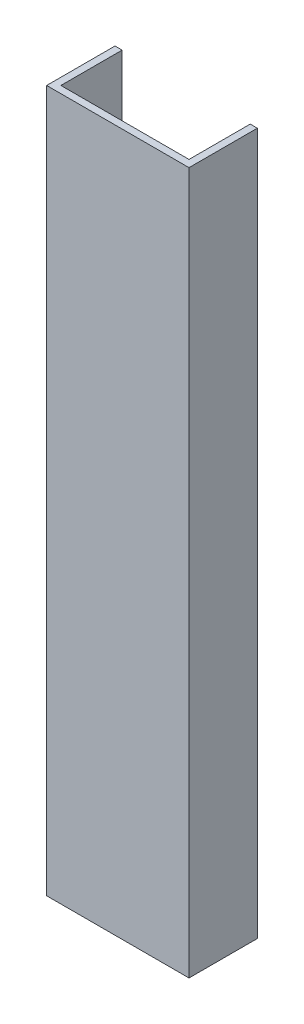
ISO-10303-21;
HEADER;
FILE_DESCRIPTION(('STEP AP214'),'2;1');
FILE_NAME('part.step','',(''),(''),'','','');
FILE_SCHEMA(('AUTOMOTIVE_DESIGN { 1 0 10303 214 1 1 1 1 }'));
ENDSEC;
DATA;
#1=APPLICATION_CONTEXT('core data for automotive mechanical design processes');
#2=APPLICATION_PROTOCOL_DEFINITION('international standard','automotive_design',2000,#1);
#3=PRODUCT_CONTEXT('',#1,'mechanical');
#4=PRODUCT('Part','Part','',(#3));
#5=PRODUCT_RELATED_PRODUCT_CATEGORY('part','',(#4));
#6=PRODUCT_DEFINITION_FORMATION('','',#4);
#7=PRODUCT_DEFINITION_CONTEXT('part definition',#1,'design');
#8=PRODUCT_DEFINITION('design','',#6,#7);
#9=PRODUCT_DEFINITION_SHAPE('','',#8);
#10=(LENGTH_UNIT() NAMED_UNIT(*) SI_UNIT(.MILLI.,.METRE.));
#11=(NAMED_UNIT(*) PLANE_ANGLE_UNIT() SI_UNIT($,.RADIAN.));
#12=(NAMED_UNIT(*) SI_UNIT($,.STERADIAN.) SOLID_ANGLE_UNIT());
#13=UNCERTAINTY_MEASURE_WITH_UNIT(LENGTH_MEASURE(1.E-05),#10,'distance_accuracy_value','');
#14=(GEOMETRIC_REPRESENTATION_CONTEXT(3) GLOBAL_UNCERTAINTY_ASSIGNED_CONTEXT((#13)) GLOBAL_UNIT_ASSIGNED_CONTEXT((#10,
#11,#12)) REPRESENTATION_CONTEXT('',''));
#15=CARTESIAN_POINT('',(0.,0.,0.));
#16=DIRECTION('',(0.,0.,1.));
#17=DIRECTION('',(1.,0.,0.));
#18=AXIS2_PLACEMENT_3D('',#15,#16,#17);
#19=CARTESIAN_POINT('',(45.,493.,-48.));
#20=DIRECTION('',(0.,0.,1.));
#21=DIRECTION('',(1.,0.,0.));
#22=AXIS2_PLACEMENT_3D('',#19,#20,#21);
#23=PLANE('',#22);
#24=DIRECTION('',(-1.,0.,0.));
#25=VECTOR('',#24,1.);
#26=CARTESIAN_POINT('',(45.,0.,-48.));
#27=LINE('',#26,#25);
#28=CARTESIAN_POINT('',(50.,0.,-48.));
#29=VERTEX_POINT('',#28);
#30=CARTESIAN_POINT('',(45.,0.,-48.));
#31=VERTEX_POINT('',#30);
#32=EDGE_CURVE('E128',#29,#31,#27,.T.);
#33=ORIENTED_EDGE('',*,*,#32,.T.);
#34=DIRECTION('',(0.,-1.,0.));
#35=VECTOR('',#34,1.);
#36=CARTESIAN_POINT('',(45.,493.,-48.));
#37=LINE('',#36,#35);
#38=CARTESIAN_POINT('',(45.,493.,-48.));
#39=VERTEX_POINT('',#38);
#40=EDGE_CURVE('E11',#39,#31,#37,.T.);
#41=ORIENTED_EDGE('',*,*,#40,.F.);
#42=DIRECTION('',(-1.,0.,0.));
#43=VECTOR('',#42,1.);
#44=CARTESIAN_POINT('',(45.,493.,-48.));
#45=LINE('',#44,#43);
#46=CARTESIAN_POINT('',(50.,493.,-48.));
#47=VERTEX_POINT('',#46);
#48=EDGE_CURVE('E142',#47,#39,#45,.T.);
#49=ORIENTED_EDGE('',*,*,#48,.F.);
#50=DIRECTION('',(0.,-1.,0.));
#51=VECTOR('',#50,1.);
#52=CARTESIAN_POINT('',(50.,493.,-48.));
#53=LINE('',#52,#51);
#54=EDGE_CURVE('E124',#47,#29,#53,.T.);
#55=ORIENTED_EDGE('',*,*,#54,.T.);
#56=EDGE_LOOP('',(#33,#41,#49,#55));
#57=FACE_BOUND('',#56,.T.);
#58=ADVANCED_FACE('F32',(#57),#23,.F.);
#59=CARTESIAN_POINT('',(45.,493.,-48.));
#60=DIRECTION('',(1.,0.,0.));
#61=DIRECTION('',(0.,0.,-1.));
#62=AXIS2_PLACEMENT_3D('',#59,#60,#61);
#63=PLANE('',#62);
#64=DIRECTION('',(0.,0.,1.));
#65=VECTOR('',#64,1.);
#66=CARTESIAN_POINT('',(45.,0.,-48.));
#67=LINE('',#66,#65);
#68=CARTESIAN_POINT('',(45.,0.,-4.99999999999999));
#69=VERTEX_POINT('',#68);
#70=EDGE_CURVE('E131',#31,#69,#67,.T.);
#71=ORIENTED_EDGE('',*,*,#70,.T.);
#72=DIRECTION('',(0.,-1.,0.));
#73=VECTOR('',#72,1.);
#74=CARTESIAN_POINT('',(45.,493.,-4.99999999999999));
#75=LINE('',#74,#73);
#76=CARTESIAN_POINT('',(45.,493.,-4.99999999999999));
#77=VERTEX_POINT('',#76);
#78=EDGE_CURVE('E40',#77,#69,#75,.T.);
#79=ORIENTED_EDGE('',*,*,#78,.F.);
#80=DIRECTION('',(0.,0.,1.));
#81=VECTOR('',#80,1.);
#82=CARTESIAN_POINT('',(45.,493.,-48.));
#83=LINE('',#82,#81);
#84=EDGE_CURVE('E91',#39,#77,#83,.T.);
#85=ORIENTED_EDGE('',*,*,#84,.F.);
#86=ORIENTED_EDGE('',*,*,#40,.T.);
#87=EDGE_LOOP('',(#71,#79,#85,#86));
#88=FACE_BOUND('',#87,.T.);
#89=ADVANCED_FACE('F177',(#88),#63,.F.);
#90=CARTESIAN_POINT('',(45.,493.,-4.99999999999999));
#91=DIRECTION('',(0.,0.,1.));
#92=DIRECTION('',(1.,0.,0.));
#93=AXIS2_PLACEMENT_3D('',#90,#91,#92);
#94=PLANE('',#93);
#95=DIRECTION('',(-1.,0.,0.));
#96=VECTOR('',#95,1.);
#97=CARTESIAN_POINT('',(45.,0.,-4.99999999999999));
#98=LINE('',#97,#96);
#99=CARTESIAN_POINT('',(-45.,0.,-4.99999999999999));
#100=VERTEX_POINT('',#99);
#101=EDGE_CURVE('E133',#69,#100,#98,.T.);
#102=ORIENTED_EDGE('',*,*,#101,.T.);
#103=DIRECTION('',(0.,-1.,0.));
#104=VECTOR('',#103,1.);
#105=CARTESIAN_POINT('',(-45.,493.,-4.99999999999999));
#106=LINE('',#105,#104);
#107=CARTESIAN_POINT('',(-45.,493.,-4.99999999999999));
#108=VERTEX_POINT('',#107);
#109=EDGE_CURVE('E149',#108,#100,#106,.T.);
#110=ORIENTED_EDGE('',*,*,#109,.F.);
#111=DIRECTION('',(-1.,0.,0.));
#112=VECTOR('',#111,1.);
#113=CARTESIAN_POINT('',(45.,493.,-4.99999999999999));
#114=LINE('',#113,#112);
#115=EDGE_CURVE('E157',#77,#108,#114,.T.);
#116=ORIENTED_EDGE('',*,*,#115,.F.);
#117=ORIENTED_EDGE('',*,*,#78,.T.);
#118=EDGE_LOOP('',(#102,#110,#116,#117));
#119=FACE_BOUND('',#118,.T.);
#120=ADVANCED_FACE('F155',(#119),#94,.F.);
#121=CARTESIAN_POINT('',(-45.,493.,-4.99999999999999));
#122=DIRECTION('',(-1.,0.,0.));
#123=DIRECTION('',(0.,0.,1.));
#124=AXIS2_PLACEMENT_3D('',#121,#122,#123);
#125=PLANE('',#124);
#126=DIRECTION('',(0.,0.,-1.));
#127=VECTOR('',#126,1.);
#128=CARTESIAN_POINT('',(-45.,0.,-4.99999999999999));
#129=LINE('',#128,#127);
#130=CARTESIAN_POINT('',(-45.,0.,-48.));
#131=VERTEX_POINT('',#130);
#132=EDGE_CURVE('E135',#100,#131,#129,.T.);
#133=ORIENTED_EDGE('',*,*,#132,.T.);
#134=DIRECTION('',(0.,-1.,0.));
#135=VECTOR('',#134,1.);
#136=CARTESIAN_POINT('',(-45.,493.,-48.));
#137=LINE('',#136,#135);
#138=CARTESIAN_POINT('',(-45.,493.,-48.));
#139=VERTEX_POINT('',#138);
#140=EDGE_CURVE('E146',#139,#131,#137,.T.);
#141=ORIENTED_EDGE('',*,*,#140,.F.);
#142=DIRECTION('',(0.,0.,-1.));
#143=VECTOR('',#142,1.);
#144=CARTESIAN_POINT('',(-45.,493.,-4.99999999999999));
#145=LINE('',#144,#143);
#146=EDGE_CURVE('E169',#108,#139,#145,.T.);
#147=ORIENTED_EDGE('',*,*,#146,.F.);
#148=ORIENTED_EDGE('',*,*,#109,.T.);
#149=EDGE_LOOP('',(#133,#141,#147,#148));
#150=FACE_BOUND('',#149,.T.);
#151=ADVANCED_FACE('F165',(#150),#125,.F.);
#152=CARTESIAN_POINT('',(-50.,493.,-48.));
#153=DIRECTION('',(0.,0.,1.));
#154=DIRECTION('',(1.,0.,0.));
#155=AXIS2_PLACEMENT_3D('',#152,#153,#154);
#156=PLANE('',#155);
#157=DIRECTION('',(-1.,0.,0.));
#158=VECTOR('',#157,1.);
#159=CARTESIAN_POINT('',(-50.,0.,-48.));
#160=LINE('',#159,#158);
#161=CARTESIAN_POINT('',(-50.,0.,-48.));
#162=VERTEX_POINT('',#161);
#163=EDGE_CURVE('E137',#131,#162,#160,.T.);
#164=ORIENTED_EDGE('',*,*,#163,.T.);
#165=DIRECTION('',(0.,-1.,0.));
#166=VECTOR('',#165,1.);
#167=CARTESIAN_POINT('',(-50.,493.,-48.));
#168=LINE('',#167,#166);
#169=CARTESIAN_POINT('',(-50.,493.,-48.));
#170=VERTEX_POINT('',#169);
#171=EDGE_CURVE('E119',#170,#162,#168,.T.);
#172=ORIENTED_EDGE('',*,*,#171,.F.);
#173=DIRECTION('',(-1.,0.,0.));
#174=VECTOR('',#173,1.);
#175=CARTESIAN_POINT('',(-50.,493.,-48.));
#176=LINE('',#175,#174);
#177=EDGE_CURVE('E110',#139,#170,#176,.T.);
#178=ORIENTED_EDGE('',*,*,#177,.F.);
#179=ORIENTED_EDGE('',*,*,#140,.T.);
#180=EDGE_LOOP('',(#164,#172,#178,#179));
#181=FACE_BOUND('',#180,.T.);
#182=ADVANCED_FACE('F168',(#181),#156,.F.);
#183=CARTESIAN_POINT('',(-50.,493.,0.));
#184=DIRECTION('',(1.,0.,0.));
#185=DIRECTION('',(0.,0.,-1.));
#186=AXIS2_PLACEMENT_3D('',#183,#184,#185);
#187=PLANE('',#186);
#188=DIRECTION('',(0.,0.,1.));
#189=VECTOR('',#188,1.);
#190=CARTESIAN_POINT('',(-50.,0.,0.));
#191=LINE('',#190,#189);
#192=CARTESIAN_POINT('',(-50.,0.,0.));
#193=VERTEX_POINT('',#192);
#194=EDGE_CURVE('E118',#162,#193,#191,.T.);
#195=ORIENTED_EDGE('',*,*,#194,.T.);
#196=DIRECTION('',(0.,-1.,0.));
#197=VECTOR('',#196,1.);
#198=CARTESIAN_POINT('',(-50.,493.,0.));
#199=LINE('',#198,#197);
#200=CARTESIAN_POINT('',(-50.,493.,0.));
#201=VERTEX_POINT('',#200);
#202=EDGE_CURVE('E115',#201,#193,#199,.T.);
#203=ORIENTED_EDGE('',*,*,#202,.F.);
#204=DIRECTION('',(0.,0.,1.));
#205=VECTOR('',#204,1.);
#206=CARTESIAN_POINT('',(-50.,493.,0.));
#207=LINE('',#206,#205);
#208=EDGE_CURVE('E104',#170,#201,#207,.T.);
#209=ORIENTED_EDGE('',*,*,#208,.F.);
#210=ORIENTED_EDGE('',*,*,#171,.T.);
#211=EDGE_LOOP('',(#195,#203,#209,#210));
#212=FACE_BOUND('',#211,.T.);
#213=ADVANCED_FACE('F116',(#212),#187,.F.);
#214=CARTESIAN_POINT('',(-50.,493.,0.));
#215=DIRECTION('',(0.,0.,-1.));
#216=DIRECTION('',(-1.,0.,0.));
#217=AXIS2_PLACEMENT_3D('',#214,#215,#216);
#218=PLANE('',#217);
#219=DIRECTION('',(1.,0.,0.));
#220=VECTOR('',#219,1.);
#221=CARTESIAN_POINT('',(-50.,0.,0.));
#222=LINE('',#221,#220);
#223=CARTESIAN_POINT('',(50.,0.,0.));
#224=VERTEX_POINT('',#223);
#225=EDGE_CURVE('E77',#193,#224,#222,.T.);
#226=ORIENTED_EDGE('',*,*,#225,.T.);
#227=DIRECTION('',(0.,-1.,0.));
#228=VECTOR('',#227,1.);
#229=CARTESIAN_POINT('',(50.,493.,0.));
#230=LINE('',#229,#228);
#231=CARTESIAN_POINT('',(50.,493.,0.));
#232=VERTEX_POINT('',#231);
#233=EDGE_CURVE('E120',#232,#224,#230,.T.);
#234=ORIENTED_EDGE('',*,*,#233,.F.);
#235=DIRECTION('',(1.,0.,0.));
#236=VECTOR('',#235,1.);
#237=CARTESIAN_POINT('',(-50.,493.,0.));
#238=LINE('',#237,#236);
#239=EDGE_CURVE('E108',#201,#232,#238,.T.);
#240=ORIENTED_EDGE('',*,*,#239,.F.);
#241=ORIENTED_EDGE('',*,*,#202,.T.);
#242=EDGE_LOOP('',(#226,#234,#240,#241));
#243=FACE_BOUND('',#242,.T.);
#244=ADVANCED_FACE('F122',(#243),#218,.F.);
#245=CARTESIAN_POINT('',(50.,493.,0.));
#246=DIRECTION('',(-1.,0.,0.));
#247=DIRECTION('',(0.,0.,1.));
#248=AXIS2_PLACEMENT_3D('',#245,#246,#247);
#249=PLANE('',#248);
#250=DIRECTION('',(0.,0.,-1.));
#251=VECTOR('',#250,1.);
#252=CARTESIAN_POINT('',(50.,0.,0.));
#253=LINE('',#252,#251);
#254=EDGE_CURVE('E83',#224,#29,#253,.T.);
#255=ORIENTED_EDGE('',*,*,#254,.T.);
#256=ORIENTED_EDGE('',*,*,#54,.F.);
#257=DIRECTION('',(0.,0.,-1.));
#258=VECTOR('',#257,1.);
#259=CARTESIAN_POINT('',(50.,493.,0.));
#260=LINE('',#259,#258);
#261=EDGE_CURVE('E48',#232,#47,#260,.T.);
#262=ORIENTED_EDGE('',*,*,#261,.F.);
#263=ORIENTED_EDGE('',*,*,#233,.T.);
#264=EDGE_LOOP('',(#255,#256,#262,#263));
#265=FACE_BOUND('',#264,.T.);
#266=ADVANCED_FACE('F193',(#265),#249,.F.);
#267=CARTESIAN_POINT('',(0.,493.,0.));
#268=DIRECTION('',(0.,1.,0.));
#269=DIRECTION('',(0.,0.,1.));
#270=AXIS2_PLACEMENT_3D('',#267,#268,#269);
#271=PLANE('',#270);
#272=ORIENTED_EDGE('',*,*,#48,.T.);
#273=ORIENTED_EDGE('',*,*,#84,.T.);
#274=ORIENTED_EDGE('',*,*,#115,.T.);
#275=ORIENTED_EDGE('',*,*,#146,.T.);
#276=ORIENTED_EDGE('',*,*,#177,.T.);
#277=ORIENTED_EDGE('',*,*,#208,.T.);
#278=ORIENTED_EDGE('',*,*,#239,.T.);
#279=ORIENTED_EDGE('',*,*,#261,.T.);
#280=EDGE_LOOP('',(#272,#273,#274,#275,#276,#277,#278,#279));
#281=FACE_BOUND('',#280,.T.);
#282=ADVANCED_FACE('F106',(#281),#271,.T.);
#283=CARTESIAN_POINT('',(0.,0.,0.));
#284=DIRECTION('',(0.,1.,0.));
#285=DIRECTION('',(0.,0.,1.));
#286=AXIS2_PLACEMENT_3D('',#283,#284,#285);
#287=PLANE('',#286);
#288=ORIENTED_EDGE('',*,*,#32,.F.);
#289=ORIENTED_EDGE('',*,*,#254,.F.);
#290=ORIENTED_EDGE('',*,*,#225,.F.);
#291=ORIENTED_EDGE('',*,*,#194,.F.);
#292=ORIENTED_EDGE('',*,*,#163,.F.);
#293=ORIENTED_EDGE('',*,*,#132,.F.);
#294=ORIENTED_EDGE('',*,*,#101,.F.);
#295=ORIENTED_EDGE('',*,*,#70,.F.);
#296=EDGE_LOOP('',(#288,#289,#290,#291,#292,#293,#294,#295));
#297=FACE_BOUND('',#296,.T.);
#298=ADVANCED_FACE('F161',(#297),#287,.F.);
#299=CLOSED_SHELL('',(#58,#89,#120,#151,#182,#213,#244,#266,#282,#298));
#300=MANIFOLD_SOLID_BREP('B2',#299);
#301=ADVANCED_BREP_SHAPE_REPRESENTATION('',(#18,#300),#14);
#302=SHAPE_DEFINITION_REPRESENTATION(#9,#301);
ENDSEC;
END-ISO-10303-21;
